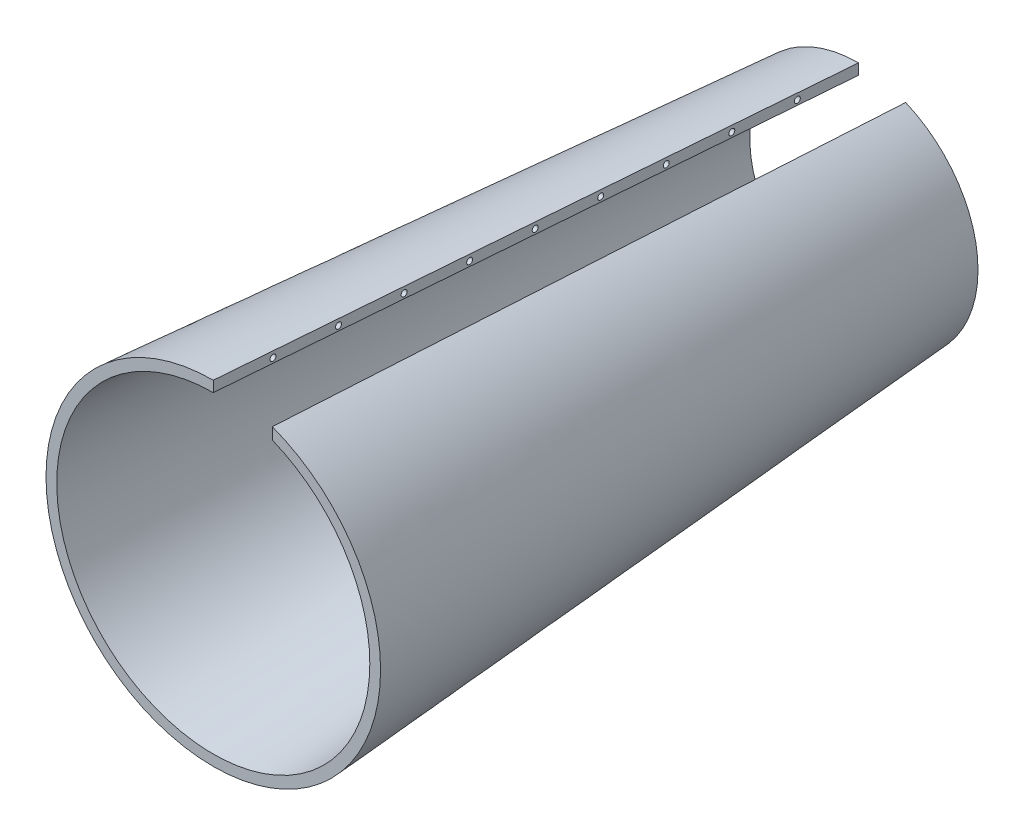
ISO-10303-21;
HEADER;
FILE_DESCRIPTION(('STEP AP214'),'2;1');
FILE_NAME('part.step','',(''),(''),'','','');
FILE_SCHEMA(('AUTOMOTIVE_DESIGN { 1 0 10303 214 1 1 1 1 }'));
ENDSEC;
DATA;
#1=APPLICATION_CONTEXT('core data for automotive mechanical design processes');
#2=APPLICATION_PROTOCOL_DEFINITION('international standard','automotive_design',2000,#1);
#3=PRODUCT_CONTEXT('',#1,'mechanical');
#4=PRODUCT('Part','Part','',(#3));
#5=PRODUCT_RELATED_PRODUCT_CATEGORY('part','',(#4));
#6=PRODUCT_DEFINITION_FORMATION('','',#4);
#7=PRODUCT_DEFINITION_CONTEXT('part definition',#1,'design');
#8=PRODUCT_DEFINITION('design','',#6,#7);
#9=PRODUCT_DEFINITION_SHAPE('','',#8);
#10=(LENGTH_UNIT() NAMED_UNIT(*) SI_UNIT(.MILLI.,.METRE.));
#11=(NAMED_UNIT(*) PLANE_ANGLE_UNIT() SI_UNIT($,.RADIAN.));
#12=(NAMED_UNIT(*) SI_UNIT($,.STERADIAN.) SOLID_ANGLE_UNIT());
#13=UNCERTAINTY_MEASURE_WITH_UNIT(LENGTH_MEASURE(1.E-05),#10,'distance_accuracy_value','');
#14=(GEOMETRIC_REPRESENTATION_CONTEXT(3) GLOBAL_UNCERTAINTY_ASSIGNED_CONTEXT((#13)) GLOBAL_UNIT_ASSIGNED_CONTEXT((#10,
#11,#12)) REPRESENTATION_CONTEXT('',''));
#15=CARTESIAN_POINT('',(0.,0.,0.));
#16=DIRECTION('',(0.,0.,1.));
#17=DIRECTION('',(1.,0.,0.));
#18=AXIS2_PLACEMENT_3D('',#15,#16,#17);
#19=CARTESIAN_POINT('',(0.,0.,270.));
#20=DIRECTION('',(0.,0.,1.));
#21=DIRECTION('',(1.,0.,0.));
#22=AXIS2_PLACEMENT_3D('',#19,#20,#21);
#23=PLANE('',#22);
#24=CARTESIAN_POINT('',(0.,0.,270.));
#25=DIRECTION('',(0.,0.,1.));
#26=DIRECTION('',(1.,0.,0.));
#27=AXIS2_PLACEMENT_3D('',#24,#25,#26);
#28=CIRCLE('',#27,70.);
#29=CARTESIAN_POINT('',(70.,0.,270.));
#30=VERTEX_POINT('',#29);
#31=CARTESIAN_POINT('',(24.6931164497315,65.5,270.));
#32=VERTEX_POINT('',#31);
#33=EDGE_CURVE('E328',#30,#32,#28,.T.);
#34=ORIENTED_EDGE('',*,*,#33,.T.);
#35=DIRECTION('',(0.,-1.,0.));
#36=VECTOR('',#35,1.);
#37=CARTESIAN_POINT('',(24.6931164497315,60.6671245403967,270.));
#38=LINE('',#37,#36);
#39=CARTESIAN_POINT('',(24.6931164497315,60.6671245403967,270.));
#40=VERTEX_POINT('',#39);
#41=EDGE_CURVE('E342',#32,#40,#38,.T.);
#42=ORIENTED_EDGE('',*,*,#41,.T.);
#43=CARTESIAN_POINT('',(0.,0.,270.));
#44=DIRECTION('',(0.,0.,-1.));
#45=DIRECTION('',(1.,0.,0.));
#46=AXIS2_PLACEMENT_3D('',#43,#44,#45);
#47=CIRCLE('',#46,65.5);
#48=CARTESIAN_POINT('',(65.5,0.,270.));
#49=VERTEX_POINT('',#48);
#50=EDGE_CURVE('E356',#40,#49,#47,.T.);
#51=ORIENTED_EDGE('',*,*,#50,.T.);
#52=CARTESIAN_POINT('',(0.,0.,270.));
#53=DIRECTION('',(0.,0.,-1.));
#54=DIRECTION('',(1.,0.,0.));
#55=AXIS2_PLACEMENT_3D('',#52,#53,#54);
#56=CIRCLE('',#55,65.5);
#57=CARTESIAN_POINT('',(0.,65.5,270.));
#58=VERTEX_POINT('',#57);
#59=EDGE_CURVE('E368',#49,#58,#56,.T.);
#60=ORIENTED_EDGE('',*,*,#59,.T.);
#61=DIRECTION('',(0.,1.,0.));
#62=VECTOR('',#61,1.);
#63=CARTESIAN_POINT('',(0.,70.,270.));
#64=LINE('',#63,#62);
#65=CARTESIAN_POINT('',(0.,70.,270.));
#66=VERTEX_POINT('',#65);
#67=EDGE_CURVE('E113',#58,#66,#64,.T.);
#68=ORIENTED_EDGE('',*,*,#67,.T.);
#69=CARTESIAN_POINT('',(0.,0.,270.));
#70=DIRECTION('',(0.,0.,1.));
#71=DIRECTION('',(1.,0.,0.));
#72=AXIS2_PLACEMENT_3D('',#69,#70,#71);
#73=CIRCLE('',#72,70.);
#74=EDGE_CURVE('E12',#66,#30,#73,.T.);
#75=ORIENTED_EDGE('',*,*,#74,.T.);
#76=EDGE_LOOP('',(#34,#42,#51,#60,#68,#75));
#77=FACE_BOUND('',#76,.T.);
#78=ADVANCED_FACE('F103',(#77),#23,.T.);
#79=CARTESIAN_POINT('',(0.,0.,0.));
#80=DIRECTION('',(0.,0.,1.));
#81=DIRECTION('',(1.,0.,0.));
#82=AXIS2_PLACEMENT_3D('',#79,#80,#81);
#83=PLANE('',#82);
#84=CARTESIAN_POINT('',(0.,0.,0.));
#85=DIRECTION('',(0.,0.,1.));
#86=DIRECTION('',(1.,0.,0.));
#87=AXIS2_PLACEMENT_3D('',#84,#85,#86);
#88=CIRCLE('',#87,50.);
#89=CARTESIAN_POINT('',(0.,50.,0.));
#90=VERTEX_POINT('',#89);
#91=CARTESIAN_POINT('',(50.,0.,0.));
#92=VERTEX_POINT('',#91);
#93=EDGE_CURVE('E161',#90,#92,#88,.T.);
#94=ORIENTED_EDGE('',*,*,#93,.F.);
#95=DIRECTION('',(0.,1.,0.));
#96=VECTOR('',#95,1.);
#97=CARTESIAN_POINT('',(0.,50.,0.));
#98=LINE('',#97,#96);
#99=CARTESIAN_POINT('',(0.,45.5,0.));
#100=VERTEX_POINT('',#99);
#101=EDGE_CURVE('E168',#100,#90,#98,.T.);
#102=ORIENTED_EDGE('',*,*,#101,.F.);
#103=CARTESIAN_POINT('',(0.,0.,0.));
#104=DIRECTION('',(0.,0.,-1.));
#105=DIRECTION('',(1.,0.,0.));
#106=AXIS2_PLACEMENT_3D('',#103,#104,#105);
#107=CIRCLE('',#106,45.5);
#108=CARTESIAN_POINT('',(45.5,0.,0.));
#109=VERTEX_POINT('',#108);
#110=EDGE_CURVE('E176',#109,#100,#107,.T.);
#111=ORIENTED_EDGE('',*,*,#110,.F.);
#112=CARTESIAN_POINT('',(0.,0.,0.));
#113=DIRECTION('',(0.,0.,-1.));
#114=DIRECTION('',(1.,0.,0.));
#115=AXIS2_PLACEMENT_3D('',#112,#113,#114);
#116=CIRCLE('',#115,45.5);
#117=CARTESIAN_POINT('',(19.7294196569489,41.,0.));
#118=VERTEX_POINT('',#117);
#119=EDGE_CURVE('E245',#118,#109,#116,.T.);
#120=ORIENTED_EDGE('',*,*,#119,.F.);
#121=DIRECTION('',(0.,-1.,0.));
#122=VECTOR('',#121,1.);
#123=CARTESIAN_POINT('',(19.7294196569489,45.5,0.));
#124=LINE('',#123,#122);
#125=CARTESIAN_POINT('',(19.7294196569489,45.5,0.));
#126=VERTEX_POINT('',#125);
#127=EDGE_CURVE('E243',#126,#118,#124,.T.);
#128=ORIENTED_EDGE('',*,*,#127,.F.);
#129=CARTESIAN_POINT('',(0.668966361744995,0.,0.));
#130=DIRECTION('',(0.,0.,1.));
#131=DIRECTION('',(1.,0.,0.));
#132=AXIS2_PLACEMENT_3D('',#129,#130,#131);
#133=CIRCLE('',#132,49.331033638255);
#134=EDGE_CURVE('E182',#92,#126,#133,.T.);
#135=ORIENTED_EDGE('',*,*,#134,.F.);
#136=EDGE_LOOP('',(#94,#102,#111,#120,#128,#135));
#137=FACE_BOUND('',#136,.T.);
#138=ADVANCED_FACE('F181',(#137),#83,.F.);
#139=CARTESIAN_POINT('',(45.5,0.,0.));
#140=CARTESIAN_POINT('',(65.5,0.,270.));
#141=CARTESIAN_POINT('',(45.5,-4.46695201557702,0.));
#142=CARTESIAN_POINT('',(65.5,-6.43044740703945,270.));
#143=CARTESIAN_POINT('',(44.175721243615,-13.4002968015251,0.));
#144=CARTESIAN_POINT('',(63.5935661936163,-19.2905530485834,270.000000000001));
#145=CARTESIAN_POINT('',(38.3829924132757,-25.646876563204,0.));
#146=CARTESIAN_POINT('',(55.2546533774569,-36.9203020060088,269.999999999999));
#147=CARTESIAN_POINT('',(29.2856677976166,-35.6844989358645,0.));
#148=CARTESIAN_POINT('',(42.1584306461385,-51.3700171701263,270.));
#149=CARTESIAN_POINT('',(17.6657844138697,-42.6491375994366,0.));
#150=CARTESIAN_POINT('',(25.4309864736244,-61.3959996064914,270.));
#151=CARTESIAN_POINT('',(4.52479025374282,-45.9407810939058,0.));
#152=CARTESIAN_POINT('',(6.51371523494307,-66.1345333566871,269.999999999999));
#153=CARTESIAN_POINT('',(-9.00599973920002,-45.2760616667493,0.));
#154=CARTESIAN_POINT('',(-12.9645719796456,-65.1776516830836,270.000000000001));
#155=CARTESIAN_POINT('',(-21.7611360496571,-40.7121918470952,0.));
#156=CARTESIAN_POINT('',(-31.3264525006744,-58.6076541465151,269.999999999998));
#157=CARTESIAN_POINT('',(-32.6422131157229,-32.642213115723,0.));
#158=CARTESIAN_POINT('',(-46.9904501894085,-46.9904501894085,270.000000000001));
#159=CARTESIAN_POINT('',(-40.7121918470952,-21.7611360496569,0.));
#160=CARTESIAN_POINT('',(-58.6076541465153,-31.3264525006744,270.));
#161=CARTESIAN_POINT('',(-45.2760616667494,-9.00599973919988,0.));
#162=CARTESIAN_POINT('',(-65.1776516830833,-12.9645719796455,269.999999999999));
#163=CARTESIAN_POINT('',(-45.9407810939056,4.52479025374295,0.));
#164=CARTESIAN_POINT('',(-66.1345333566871,6.51371523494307,270.000000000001));
#165=CARTESIAN_POINT('',(-42.6491375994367,17.6657844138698,0.));
#166=CARTESIAN_POINT('',(-61.3959996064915,25.4309864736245,270.));
#167=CARTESIAN_POINT('',(-35.6844989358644,29.2856677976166,0.));
#168=CARTESIAN_POINT('',(-51.3700171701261,42.1584306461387,270.));
#169=CARTESIAN_POINT('',(-25.6468765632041,38.3829924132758,0.));
#170=CARTESIAN_POINT('',(-36.9203020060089,55.2546533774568,270.));
#171=CARTESIAN_POINT('',(-13.400296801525,44.1757212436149,0.));
#172=CARTESIAN_POINT('',(-19.2905530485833,63.5935661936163,269.999999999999));
#173=CARTESIAN_POINT('',(-4.46695201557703,45.5,0.));
#174=CARTESIAN_POINT('',(-6.43044740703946,65.5,270.));
#175=CARTESIAN_POINT('',(0.,45.5,0.));
#176=CARTESIAN_POINT('',(0.,65.5,270.));
#177=B_SPLINE_SURFACE_WITH_KNOTS('',3,1,((#139,#140),(#141,#142),(#143,#144),(#145,#146),(#147,
#148),(#149,#150),(#151,#152),(#153,#154),(#155,#156),(#157,#158),(#159,#160),(#161,#162),(#163,
#164),(#165,#166),(#167,#168),(#169,#170),(#171,#172),(#173,#174),(#175,#176)),.UNSPECIFIED.,
.F.,.F.,.F.,(4,1,1,1,1,1,1,1,1,1,1,1,1,1,1,1,4),(2,2),(0.,0.0625,0.125,0.1875,0.25,0.3125,0.375,
0.4375,0.5,0.5625,0.625,0.6875,0.75,0.8125,0.875,0.9375,1.),(0.,1.),.UNSPECIFIED.);
#178=DIRECTION('',(0.,0.0738716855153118,0.997267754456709));
#179=VECTOR('',#178,1.);
#180=CARTESIAN_POINT('',(0.,55.5,135.));
#181=LINE('',#180,#179);
#182=EDGE_CURVE('E165',#100,#58,#181,.T.);
#183=DIRECTION('',(-0.0738716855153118,0.,-0.997267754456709));
#184=VECTOR('',#183,1.);
#185=CARTESIAN_POINT('',(55.5,0.,135.));
#186=LINE('',#185,#184);
#187=EDGE_CURVE('E175',#49,#109,#186,.T.);
#188=ORIENTED_EDGE('',*,*,#110,.T.);
#189=ORIENTED_EDGE('',*,*,#182,.T.);
#190=ORIENTED_EDGE('',*,*,#59,.F.);
#191=ORIENTED_EDGE('',*,*,#187,.T.);
#192=EDGE_LOOP('',(#188,#189,#190,#191));
#193=FACE_BOUND('',#192,.T.);
#194=ADVANCED_FACE('F205',(#193),#177,.T.);
#195=CARTESIAN_POINT('',(0.,45.5,0.));
#196=DIRECTION('',(1.,0.,0.));
#197=DIRECTION('',(0.,1.,0.));
#198=AXIS2_PLACEMENT_3D('',#195,#196,#197);
#199=PLANE('',#198);
#200=CARTESIAN_POINT('',(0.,65.6412988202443,245.));
#201=DIRECTION('',(1.,0.,0.));
#202=DIRECTION('',(0.,0.,-1.));
#203=AXIS2_PLACEMENT_3D('',#200,#201,#202);
#204=CIRCLE('',#203,1.24999999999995);
#205=CARTESIAN_POINT('',(0.,65.6412988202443,243.75));
#206=VERTEX_POINT('',#205);
#207=EDGE_CURVE('E955',#206,#206,#204,.T.);
#208=ORIENTED_EDGE('',*,*,#207,.F.);
#209=EDGE_LOOP('',(#208));
#210=FACE_BOUND('',#209,.T.);
#211=CARTESIAN_POINT('',(0.,63.6098274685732,217.575136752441));
#212=DIRECTION('',(1.,0.,0.));
#213=DIRECTION('',(0.,0.,-1.));
#214=AXIS2_PLACEMENT_3D('',#211,#212,#213);
#215=CIRCLE('',#214,1.24999999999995);
#216=CARTESIAN_POINT('',(0.,63.6098274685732,216.325136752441));
#217=VERTEX_POINT('',#216);
#218=EDGE_CURVE('E960',#217,#217,#215,.T.);
#219=ORIENTED_EDGE('',*,*,#218,.F.);
#220=EDGE_LOOP('',(#219));
#221=FACE_BOUND('',#220,.T.);
#222=CARTESIAN_POINT('',(0.,61.5783561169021,190.150273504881));
#223=DIRECTION('',(1.,0.,0.));
#224=DIRECTION('',(0.,0.,-1.));
#225=AXIS2_PLACEMENT_3D('',#222,#223,#224);
#226=CIRCLE('',#225,1.24999999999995);
#227=CARTESIAN_POINT('',(0.,61.5783561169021,188.900273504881));
#228=VERTEX_POINT('',#227);
#229=EDGE_CURVE('E968',#228,#228,#226,.T.);
#230=ORIENTED_EDGE('',*,*,#229,.F.);
#231=EDGE_LOOP('',(#230));
#232=FACE_BOUND('',#231,.T.);
#233=CARTESIAN_POINT('',(0.,59.5468847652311,162.725410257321));
#234=DIRECTION('',(1.,0.,0.));
#235=DIRECTION('',(0.,0.,-1.));
#236=AXIS2_PLACEMENT_3D('',#233,#234,#235);
#237=CIRCLE('',#236,1.24999999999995);
#238=CARTESIAN_POINT('',(0.,59.5468847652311,161.475410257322));
#239=VERTEX_POINT('',#238);
#240=EDGE_CURVE('E974',#239,#239,#237,.T.);
#241=ORIENTED_EDGE('',*,*,#240,.F.);
#242=EDGE_LOOP('',(#241));
#243=FACE_BOUND('',#242,.T.);
#244=CARTESIAN_POINT('',(0.,57.51541341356,135.300547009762));
#245=DIRECTION('',(1.,0.,0.));
#246=DIRECTION('',(0.,0.,-1.));
#247=AXIS2_PLACEMENT_3D('',#244,#245,#246);
#248=CIRCLE('',#247,1.24999999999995);
#249=CARTESIAN_POINT('',(0.,57.51541341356,134.050547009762));
#250=VERTEX_POINT('',#249);
#251=EDGE_CURVE('E980',#250,#250,#248,.T.);
#252=ORIENTED_EDGE('',*,*,#251,.F.);
#253=EDGE_LOOP('',(#252));
#254=FACE_BOUND('',#253,.T.);
#255=CARTESIAN_POINT('',(0.,55.4839420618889,107.875683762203));
#256=DIRECTION('',(1.,0.,0.));
#257=DIRECTION('',(0.,0.,-1.));
#258=AXIS2_PLACEMENT_3D('',#255,#256,#257);
#259=CIRCLE('',#258,1.24999999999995);
#260=CARTESIAN_POINT('',(0.,55.4839420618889,106.625683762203));
#261=VERTEX_POINT('',#260);
#262=EDGE_CURVE('E986',#261,#261,#259,.T.);
#263=ORIENTED_EDGE('',*,*,#262,.F.);
#264=EDGE_LOOP('',(#263));
#265=FACE_BOUND('',#264,.T.);
#266=CARTESIAN_POINT('',(0.,53.4524707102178,80.450820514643));
#267=DIRECTION('',(1.,0.,0.));
#268=DIRECTION('',(0.,0.,-1.));
#269=AXIS2_PLACEMENT_3D('',#266,#267,#268);
#270=CIRCLE('',#269,1.24999999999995);
#271=CARTESIAN_POINT('',(0.,53.4524707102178,79.200820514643));
#272=VERTEX_POINT('',#271);
#273=EDGE_CURVE('E992',#272,#272,#270,.T.);
#274=ORIENTED_EDGE('',*,*,#273,.F.);
#275=EDGE_LOOP('',(#274));
#276=FACE_BOUND('',#275,.T.);
#277=CARTESIAN_POINT('',(0.,51.4209993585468,53.0259572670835));
#278=DIRECTION('',(1.,0.,0.));
#279=DIRECTION('',(0.,0.,-1.));
#280=AXIS2_PLACEMENT_3D('',#277,#278,#279);
#281=CIRCLE('',#280,1.24999999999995);
#282=CARTESIAN_POINT('',(0.,51.4209993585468,51.7759572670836));
#283=VERTEX_POINT('',#282);
#284=EDGE_CURVE('E998',#283,#283,#281,.T.);
#285=ORIENTED_EDGE('',*,*,#284,.F.);
#286=EDGE_LOOP('',(#285));
#287=FACE_BOUND('',#286,.T.);
#288=CARTESIAN_POINT('',(0.,49.3895280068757,25.601094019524));
#289=DIRECTION('',(1.,0.,0.));
#290=DIRECTION('',(0.,0.,-1.));
#291=AXIS2_PLACEMENT_3D('',#288,#289,#290);
#292=CIRCLE('',#291,1.24999999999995);
#293=CARTESIAN_POINT('',(0.,49.3895280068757,24.3510940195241));
#294=VERTEX_POINT('',#293);
#295=EDGE_CURVE('E1004',#294,#294,#292,.T.);
#296=ORIENTED_EDGE('',*,*,#295,.F.);
#297=EDGE_LOOP('',(#296));
#298=FACE_BOUND('',#297,.T.);
#299=ORIENTED_EDGE('',*,*,#101,.T.);
#300=DIRECTION('',(0.,0.0738716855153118,0.997267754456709));
#301=VECTOR('',#300,1.);
#302=CARTESIAN_POINT('',(0.,60.,135.));
#303=LINE('',#302,#301);
#304=EDGE_CURVE('E128',#90,#66,#303,.T.);
#305=ORIENTED_EDGE('',*,*,#304,.T.);
#306=ORIENTED_EDGE('',*,*,#67,.F.);
#307=ORIENTED_EDGE('',*,*,#182,.F.);
#308=EDGE_LOOP('',(#299,#305,#306,#307));
#309=FACE_BOUND('',#308,.T.);
#310=ADVANCED_FACE('F170',(#210,#221,#232,#243,#254,#265,#276,#287,#298,#309),#199,.T.);
#311=CARTESIAN_POINT('',(19.7294196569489,41.,0.));
#312=CARTESIAN_POINT('',(24.6931164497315,60.6671245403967,270.));
#313=CARTESIAN_POINT('',(23.5639349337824,39.1548107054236,0.));
#314=CARTESIAN_POINT('',(30.6801905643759,58.2302277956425,270.));
#315=CARTESIAN_POINT('',(30.7118644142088,34.3822893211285,0.));
#316=CARTESIAN_POINT('',(41.9274824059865,51.5723371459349,270.));
#317=CARTESIAN_POINT('',(39.0312208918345,24.5331027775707,0.));
#318=CARTESIAN_POINT('',(55.1491661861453,37.095306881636,270.));
#319=CARTESIAN_POINT('',(44.2989257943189,12.7657983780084,0.));
#320=CARTESIAN_POINT('',(63.5735207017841,19.3914209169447,270.));
#321=CARTESIAN_POINT('',(45.5,4.25537670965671,0.));
#322=CARTESIAN_POINT('',(65.5,6.46401749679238,270.));
#323=CARTESIAN_POINT('',(45.5,0.,0.));
#324=CARTESIAN_POINT('',(65.5,0.,270.));
#325=B_SPLINE_SURFACE_WITH_KNOTS('',3,1,((#311,#312),(#313,#314),(#315,#316),(#317,#318),(#319,
#320),(#321,#322),(#323,#324)),.UNSPECIFIED.,.F.,.F.,.F.,(4,1,1,1,4),(2,2),(0.,0.25,0.5,0.75,
1.),(0.,1.),.UNSPECIFIED.);
#326=DIRECTION('',(0.0183324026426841,0.0726365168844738,0.99718998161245));
#327=VECTOR('',#326,1.);
#328=CARTESIAN_POINT('',(22.2112680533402,50.8335622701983,135.));
#329=LINE('',#328,#327);
#330=EDGE_CURVE('E399',#118,#40,#329,.T.);
#331=ORIENTED_EDGE('',*,*,#119,.T.);
#332=ORIENTED_EDGE('',*,*,#187,.F.);
#333=ORIENTED_EDGE('',*,*,#50,.F.);
#334=ORIENTED_EDGE('',*,*,#330,.F.);
#335=EDGE_LOOP('',(#331,#332,#333,#334));
#336=FACE_BOUND('',#335,.T.);
#337=ADVANCED_FACE('F270',(#336),#325,.T.);
#338=CARTESIAN_POINT('',(0.,50.,0.));
#339=CARTESIAN_POINT('',(0.,70.,270.));
#340=CARTESIAN_POINT('',(-2.44366964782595,50.,0.));
#341=CARTESIAN_POINT('',(-3.45137751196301,70.,270.));
#342=CARTESIAN_POINT('',(-7.33292244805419,49.6393433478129,0.));
#343=CARTESIAN_POINT('',(-10.3508208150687,69.487491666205,270.000000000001));
#344=CARTESIAN_POINT('',(-16.9094329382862,47.5022508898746,0.));
#345=CARTESIAN_POINT('',(-23.8401649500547,66.4499325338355,269.999999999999));
#346=CARTESIAN_POINT('',(-28.1082381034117,42.2266383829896,0.));
#347=CARTESIAN_POINT('',(-39.5630912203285,58.9836358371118,270.000000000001));
#348=CARTESIAN_POINT('',(-39.1483836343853,32.2607125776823,0.));
#349=CARTESIAN_POINT('',(-54.9915473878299,44.9430755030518,269.999999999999));
#350=CARTESIAN_POINT('',(-46.8294979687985,19.5059073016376,0.));
#351=CARTESIAN_POINT('',(-65.6669107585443,27.0469102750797,270.000000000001));
#352=CARTESIAN_POINT('',(-50.4777729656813,5.05809426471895,0.));
#353=CARTESIAN_POINT('',(-70.6872960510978,6.84016965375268,269.999999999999));
#354=CARTESIAN_POINT('',(-49.7686934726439,-9.83591105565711,0.));
#355=CARTESIAN_POINT('',(-69.6344475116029,-13.9408363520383,270.));
#356=CARTESIAN_POINT('',(-44.756885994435,-23.8858803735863,0.));
#357=CARTESIAN_POINT('',(-62.6085430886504,-33.5173127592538,270.));
#358=CARTESIAN_POINT('',(-35.8728851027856,-35.8728851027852,0.));
#359=CARTESIAN_POINT('',(-50.2155049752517,-50.2155049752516,270.));
#360=CARTESIAN_POINT('',(-23.8858803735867,-44.7568859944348,0.));
#361=CARTESIAN_POINT('',(-33.517312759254,-62.6085430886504,270.));
#362=CARTESIAN_POINT('',(-9.83591105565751,-49.7686934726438,0.));
#363=CARTESIAN_POINT('',(-13.9408363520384,-69.6344475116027,270.));
#364=CARTESIAN_POINT('',(5.05809426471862,-50.4777729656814,0.));
#365=CARTESIAN_POINT('',(6.84016965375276,-70.6872960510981,270.));
#366=CARTESIAN_POINT('',(19.5059073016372,-46.8294979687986,0.));
#367=CARTESIAN_POINT('',(27.0469102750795,-65.6669107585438,269.999999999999));
#368=CARTESIAN_POINT('',(32.2607125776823,-39.1483836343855,0.));
#369=CARTESIAN_POINT('',(44.9430755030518,-54.9915473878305,270.000000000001));
#370=CARTESIAN_POINT('',(42.2266383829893,-28.1082381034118,0.));
#371=CARTESIAN_POINT('',(58.9836358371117,-39.5630912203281,269.999999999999));
#372=CARTESIAN_POINT('',(47.5022508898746,-16.9094329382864,0.));
#373=CARTESIAN_POINT('',(66.4499325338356,-23.8401649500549,270.000000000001));
#374=CARTESIAN_POINT('',(49.6393433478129,-7.33292244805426,0.));
#375=CARTESIAN_POINT('',(69.4874916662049,-10.3508208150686,270.));
#376=CARTESIAN_POINT('',(50.,-2.44366964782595,0.));
#377=CARTESIAN_POINT('',(70.,-3.45137751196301,270.));
#378=CARTESIAN_POINT('',(50.,2.45610200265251,0.));
#379=CARTESIAN_POINT('',(70.,3.46893665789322,270.));
#380=CARTESIAN_POINT('',(49.6325193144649,7.33417139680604,0.));
#381=CARTESIAN_POINT('',(69.4829575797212,10.4515492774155,270.));
#382=CARTESIAN_POINT('',(48.0297048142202,14.4225118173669,0.));
#383=CARTESIAN_POINT('',(67.1222749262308,20.7926617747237,270.));
#384=CARTESIAN_POINT('',(45.4261454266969,21.1557287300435,0.));
#385=CARTESIAN_POINT('',(63.1990717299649,30.7245837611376,270.));
#386=CARTESIAN_POINT('',(41.8863834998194,27.4214315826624,0.));
#387=CARTESIAN_POINT('',(57.793873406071,39.9764930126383,270.));
#388=CARTESIAN_POINT('',(37.474961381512,33.1072298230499,0.));
#389=CARTESIAN_POINT('',(51.0434610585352,48.2979067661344,270.));
#390=CARTESIAN_POINT('',(32.2706036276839,38.110168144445,0.));
#391=CARTESIAN_POINT('',(43.1339642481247,55.4724769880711,270.000000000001));
#392=CARTESIAN_POINT('',(26.3520347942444,42.3272912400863,0.));
#393=CARTESIAN_POINT('',(34.2903891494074,61.3293199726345,269.999999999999));
#394=CARTESIAN_POINT('',(21.9947814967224,44.5510148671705,0.));
#395=CARTESIAN_POINT('',(27.9390500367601,64.2763020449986,270.));
#396=CARTESIAN_POINT('',(19.7294196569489,45.5,0.));
#397=CARTESIAN_POINT('',(24.6931164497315,65.5,270.));
#398=B_SPLINE_SURFACE_WITH_KNOTS('',3,1,((#338,#339),(#340,#341),(#342,#343),(#344,#345),(#346,
#347),(#348,#349),(#350,#351),(#352,#353),(#354,#355),(#356,#357),(#358,#359),(#360,#361),(#362,
#363),(#364,#365),(#366,#367),(#368,#369),(#370,#371),(#372,#373),(#374,#375),(#376,#377),(#378,
#379),(#380,#381),(#382,#383),(#384,#385),(#386,#387),(#388,#389),(#390,#391),(#392,#393),(#394,
#395),(#396,#397)),.UNSPECIFIED.,.F.,.F.,.F.,(4,1,1,1,1,1,1,1,1,1,1,1,1,1,1,1,1,1,2,1,1,1,1,1,1,
1,4),(2,2),(0.,0.0249745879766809,0.0499491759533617,0.0998983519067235,0.149847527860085,
0.199796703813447,0.249745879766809,0.29969505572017,0.349644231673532,0.399593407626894,
0.449542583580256,0.499491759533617,0.549440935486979,0.599390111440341,0.649339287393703,
0.699288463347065,0.749237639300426,0.774212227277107,0.799186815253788,0.824288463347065,
0.849390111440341,0.874491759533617,0.899593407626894,0.924695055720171,0.949796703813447,
0.974898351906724,1.),(0.,1.),.UNSPECIFIED.);
#399=DIRECTION('',(0.0183307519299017,0.0738592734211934,0.99710019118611));
#400=VECTOR('',#399,1.);
#401=CARTESIAN_POINT('',(22.2112680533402,55.5,135.));
#402=LINE('',#401,#400);
#403=EDGE_CURVE('E164',#126,#32,#402,.T.);
#404=ORIENTED_EDGE('',*,*,#93,.T.);
#405=ORIENTED_EDGE('',*,*,#134,.T.);
#406=ORIENTED_EDGE('',*,*,#403,.T.);
#407=ORIENTED_EDGE('',*,*,#33,.F.);
#408=ORIENTED_EDGE('',*,*,#74,.F.);
#409=ORIENTED_EDGE('',*,*,#304,.F.);
#410=EDGE_LOOP('',(#404,#405,#406,#407,#408,#409));
#411=FACE_BOUND('',#410,.T.);
#412=ADVANCED_FACE('F158',(#411),#398,.T.);
#413=CARTESIAN_POINT('',(19.7294196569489,45.5,0.));
#414=DIRECTION('',(-0.999831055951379,0.,0.0183809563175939));
#415=DIRECTION('',(0.,-1.,0.));
#416=AXIS2_PLACEMENT_3D('',#413,#414,#415);
#417=PLANE('',#416);
#418=CARTESIAN_POINT('',(24.1876401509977,60.9564600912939,242.504645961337));
#419=DIRECTION('',(-0.99983105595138,0.,0.0183809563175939));
#420=DIRECTION('',(0.0183809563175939,0.,0.99983105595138));
#421=AXIS2_PLACEMENT_3D('',#418,#419,#420);
#422=CIRCLE('',#421,1.24999999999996);
#423=CARTESIAN_POINT('',(24.2106163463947,60.9564600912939,243.754434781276));
#424=VERTEX_POINT('',#423);
#425=EDGE_CURVE('E1012',#424,#424,#422,.T.);
#426=ORIENTED_EDGE('',*,*,#425,.F.);
#427=EDGE_LOOP('',(#426));
#428=FACE_BOUND('',#427,.T.);
#429=CARTESIAN_POINT('',(23.6835444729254,58.9253300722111,215.084390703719));
#430=DIRECTION('',(-0.99983105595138,0.,0.0183809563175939));
#431=DIRECTION('',(0.0183809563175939,0.,0.99983105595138));
#432=AXIS2_PLACEMENT_3D('',#429,#430,#431);
#433=CIRCLE('',#432,1.24999999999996);
#434=CARTESIAN_POINT('',(23.7065206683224,58.9253300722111,216.334179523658));
#435=VERTEX_POINT('',#434);
#436=EDGE_CURVE('E1015',#435,#435,#433,.T.);
#437=ORIENTED_EDGE('',*,*,#436,.F.);
#438=EDGE_LOOP('',(#437));
#439=FACE_BOUND('',#438,.T.);
#440=CARTESIAN_POINT('',(23.1794487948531,56.8942000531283,187.664135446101));
#441=DIRECTION('',(-0.99983105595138,0.,0.0183809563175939));
#442=DIRECTION('',(0.0183809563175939,0.,0.99983105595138));
#443=AXIS2_PLACEMENT_3D('',#440,#441,#442);
#444=CIRCLE('',#443,1.24999999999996);
#445=CARTESIAN_POINT('',(23.2024249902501,56.8942000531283,188.91392426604));
#446=VERTEX_POINT('',#445);
#447=EDGE_CURVE('E1021',#446,#446,#444,.T.);
#448=ORIENTED_EDGE('',*,*,#447,.F.);
#449=EDGE_LOOP('',(#448));
#450=FACE_BOUND('',#449,.T.);
#451=CARTESIAN_POINT('',(22.6753531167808,54.8630700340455,160.243880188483));
#452=DIRECTION('',(-0.99983105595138,0.,0.0183809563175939));
#453=DIRECTION('',(0.0183809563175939,0.,0.99983105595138));
#454=AXIS2_PLACEMENT_3D('',#451,#452,#453);
#455=CIRCLE('',#454,1.24999999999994);
#456=CARTESIAN_POINT('',(22.6983293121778,54.8630700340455,161.493669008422));
#457=VERTEX_POINT('',#456);
#458=EDGE_CURVE('E1027',#457,#457,#455,.T.);
#459=ORIENTED_EDGE('',*,*,#458,.F.);
#460=EDGE_LOOP('',(#459));
#461=FACE_BOUND('',#460,.T.);
#462=CARTESIAN_POINT('',(22.1712574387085,52.8319400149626,132.823624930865));
#463=DIRECTION('',(-0.99983105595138,0.,0.0183809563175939));
#464=DIRECTION('',(0.0183809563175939,0.,0.99983105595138));
#465=AXIS2_PLACEMENT_3D('',#462,#463,#464);
#466=CIRCLE('',#465,1.24999999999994);
#467=CARTESIAN_POINT('',(22.1942336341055,52.8319400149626,134.073413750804));
#468=VERTEX_POINT('',#467);
#469=EDGE_CURVE('E1033',#468,#468,#466,.T.);
#470=ORIENTED_EDGE('',*,*,#469,.F.);
#471=EDGE_LOOP('',(#470));
#472=FACE_BOUND('',#471,.T.);
#473=CARTESIAN_POINT('',(21.6671617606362,50.8008099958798,105.403369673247));
#474=DIRECTION('',(-0.99983105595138,0.,0.0183809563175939));
#475=DIRECTION('',(0.0183809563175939,0.,0.99983105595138));
#476=AXIS2_PLACEMENT_3D('',#473,#474,#475);
#477=CIRCLE('',#476,1.24999999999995);
#478=CARTESIAN_POINT('',(21.6901379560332,50.8008099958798,106.653158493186));
#479=VERTEX_POINT('',#478);
#480=EDGE_CURVE('E1039',#479,#479,#477,.T.);
#481=ORIENTED_EDGE('',*,*,#480,.F.);
#482=EDGE_LOOP('',(#481));
#483=FACE_BOUND('',#482,.T.);
#484=CARTESIAN_POINT('',(21.1630660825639,48.769679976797,77.9831144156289));
#485=DIRECTION('',(-0.99983105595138,0.,0.0183809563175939));
#486=DIRECTION('',(0.0183809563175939,0.,0.99983105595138));
#487=AXIS2_PLACEMENT_3D('',#484,#485,#486);
#488=CIRCLE('',#487,1.24999999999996);
#489=CARTESIAN_POINT('',(21.1860422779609,48.769679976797,79.2329032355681));
#490=VERTEX_POINT('',#489);
#491=EDGE_CURVE('E1045',#490,#490,#488,.T.);
#492=ORIENTED_EDGE('',*,*,#491,.F.);
#493=EDGE_LOOP('',(#492));
#494=FACE_BOUND('',#493,.T.);
#495=CARTESIAN_POINT('',(20.6589704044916,46.7385499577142,50.5628591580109));
#496=DIRECTION('',(-0.99983105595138,0.,0.0183809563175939));
#497=DIRECTION('',(0.0183809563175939,0.,0.99983105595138));
#498=AXIS2_PLACEMENT_3D('',#495,#496,#497);
#499=CIRCLE('',#498,1.24999999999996);
#500=CARTESIAN_POINT('',(20.6819465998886,46.7385499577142,51.81264797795));
#501=VERTEX_POINT('',#500);
#502=EDGE_CURVE('E1051',#501,#501,#499,.T.);
#503=ORIENTED_EDGE('',*,*,#502,.F.);
#504=EDGE_LOOP('',(#503));
#505=FACE_BOUND('',#504,.T.);
#506=CARTESIAN_POINT('',(20.1548747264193,44.7074199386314,23.1426039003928));
#507=DIRECTION('',(-0.99983105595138,0.,0.0183809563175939));
#508=DIRECTION('',(0.0183809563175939,0.,0.99983105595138));
#509=AXIS2_PLACEMENT_3D('',#506,#507,#508);
#510=CIRCLE('',#509,1.24999999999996);
#511=CARTESIAN_POINT('',(20.1778509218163,44.7074199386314,24.392392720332));
#512=VERTEX_POINT('',#511);
#513=EDGE_CURVE('E958',#512,#512,#510,.T.);
#514=ORIENTED_EDGE('',*,*,#513,.F.);
#515=EDGE_LOOP('',(#514));
#516=FACE_BOUND('',#515,.T.);
#517=ORIENTED_EDGE('',*,*,#127,.T.);
#518=ORIENTED_EDGE('',*,*,#330,.T.);
#519=ORIENTED_EDGE('',*,*,#41,.F.);
#520=ORIENTED_EDGE('',*,*,#403,.F.);
#521=EDGE_LOOP('',(#517,#518,#519,#520));
#522=FACE_BOUND('',#521,.T.);
#523=ADVANCED_FACE('F303',(#428,#439,#450,#461,#472,#483,#494,#505,#516,#522),#417,.T.);
#524=CARTESIAN_POINT('',(22.6544523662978,44.7074199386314,23.0966515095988));
#525=DIRECTION('',(-0.99983105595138,0.,0.0183809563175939));
#526=DIRECTION('',(0.0183809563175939,0.,0.99983105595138));
#527=AXIS2_PLACEMENT_3D('',#524,#525,#526);
#528=CYLINDRICAL_SURFACE('',#527,1.24999999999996);
#529=CARTESIAN_POINT('',(22.6544523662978,44.7074199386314,23.0966515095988));
#530=DIRECTION('',(-0.99983105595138,0.,0.0183809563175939));
#531=DIRECTION('',(0.0183809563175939,0.,0.99983105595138));
#532=AXIS2_PLACEMENT_3D('',#529,#530,#531);
#533=CIRCLE('',#532,1.24999999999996);
#534=CARTESIAN_POINT('',(22.6774285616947,44.7074199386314,24.346440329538));
#535=VERTEX_POINT('',#534);
#536=EDGE_CURVE('E954',#535,#535,#533,.T.);
#537=ORIENTED_EDGE('',*,*,#536,.F.);
#538=EDGE_LOOP('',(#537));
#539=FACE_BOUND('',#538,.T.);
#540=ORIENTED_EDGE('',*,*,#513,.T.);
#541=EDGE_LOOP('',(#540));
#542=FACE_BOUND('',#541,.T.);
#543=ADVANCED_FACE('F460',(#539,#542),#528,.F.);
#544=CARTESIAN_POINT('',(22.6544523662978,44.7074199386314,23.0966515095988));
#545=DIRECTION('',(-0.99983105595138,0.,0.0183809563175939));
#546=DIRECTION('',(0.0183809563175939,0.,0.99983105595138));
#547=AXIS2_PLACEMENT_3D('',#544,#545,#546);
#548=PLANE('',#547);
#549=ORIENTED_EDGE('',*,*,#536,.T.);
#550=EDGE_LOOP('',(#549));
#551=FACE_BOUND('',#550,.T.);
#552=ADVANCED_FACE('F206',(#551),#548,.T.);
#553=CARTESIAN_POINT('',(23.1585480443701,46.7385499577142,50.5169067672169));
#554=DIRECTION('',(-0.99983105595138,0.,0.0183809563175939));
#555=DIRECTION('',(0.0183809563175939,0.,0.99983105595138));
#556=AXIS2_PLACEMENT_3D('',#553,#554,#555);
#557=CYLINDRICAL_SURFACE('',#556,1.24999999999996);
#558=CARTESIAN_POINT('',(23.1585480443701,46.7385499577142,50.5169067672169));
#559=DIRECTION('',(-0.99983105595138,0.,0.0183809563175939));
#560=DIRECTION('',(0.0183809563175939,0.,0.99983105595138));
#561=AXIS2_PLACEMENT_3D('',#558,#559,#560);
#562=CIRCLE('',#561,1.24999999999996);
#563=CARTESIAN_POINT('',(23.181524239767,46.7385499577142,51.7666955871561));
#564=VERTEX_POINT('',#563);
#565=EDGE_CURVE('E1054',#564,#564,#562,.T.);
#566=ORIENTED_EDGE('',*,*,#565,.F.);
#567=EDGE_LOOP('',(#566));
#568=FACE_BOUND('',#567,.T.);
#569=ORIENTED_EDGE('',*,*,#502,.T.);
#570=EDGE_LOOP('',(#569));
#571=FACE_BOUND('',#570,.T.);
#572=ADVANCED_FACE('F517',(#568,#571),#557,.F.);
#573=CARTESIAN_POINT('',(23.1585480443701,46.7385499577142,50.5169067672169));
#574=DIRECTION('',(-0.99983105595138,0.,0.0183809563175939));
#575=DIRECTION('',(0.0183809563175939,0.,0.99983105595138));
#576=AXIS2_PLACEMENT_3D('',#573,#574,#575);
#577=PLANE('',#576);
#578=ORIENTED_EDGE('',*,*,#565,.T.);
#579=EDGE_LOOP('',(#578));
#580=FACE_BOUND('',#579,.T.);
#581=ADVANCED_FACE('F527',(#580),#577,.T.);
#582=CARTESIAN_POINT('',(23.6626437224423,48.769679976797,77.9371620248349));
#583=DIRECTION('',(-0.99983105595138,0.,0.0183809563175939));
#584=DIRECTION('',(0.0183809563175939,0.,0.99983105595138));
#585=AXIS2_PLACEMENT_3D('',#582,#583,#584);
#586=CYLINDRICAL_SURFACE('',#585,1.24999999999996);
#587=CARTESIAN_POINT('',(23.6626437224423,48.769679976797,77.9371620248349));
#588=DIRECTION('',(-0.99983105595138,0.,0.0183809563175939));
#589=DIRECTION('',(0.0183809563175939,0.,0.99983105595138));
#590=AXIS2_PLACEMENT_3D('',#587,#588,#589);
#591=CIRCLE('',#590,1.24999999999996);
#592=CARTESIAN_POINT('',(23.6856199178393,48.769679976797,79.1869508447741));
#593=VERTEX_POINT('',#592);
#594=EDGE_CURVE('E1048',#593,#593,#591,.T.);
#595=ORIENTED_EDGE('',*,*,#594,.F.);
#596=EDGE_LOOP('',(#595));
#597=FACE_BOUND('',#596,.T.);
#598=ORIENTED_EDGE('',*,*,#491,.T.);
#599=EDGE_LOOP('',(#598));
#600=FACE_BOUND('',#599,.T.);
#601=ADVANCED_FACE('F538',(#597,#600),#586,.F.);
#602=CARTESIAN_POINT('',(23.6626437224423,48.769679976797,77.9371620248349));
#603=DIRECTION('',(-0.99983105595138,0.,0.0183809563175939));
#604=DIRECTION('',(0.0183809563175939,0.,0.99983105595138));
#605=AXIS2_PLACEMENT_3D('',#602,#603,#604);
#606=PLANE('',#605);
#607=ORIENTED_EDGE('',*,*,#594,.T.);
#608=EDGE_LOOP('',(#607));
#609=FACE_BOUND('',#608,.T.);
#610=ADVANCED_FACE('F549',(#609),#606,.T.);
#611=CARTESIAN_POINT('',(24.1667394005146,50.8008099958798,105.357417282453));
#612=DIRECTION('',(-0.99983105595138,0.,0.0183809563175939));
#613=DIRECTION('',(0.0183809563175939,0.,0.99983105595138));
#614=AXIS2_PLACEMENT_3D('',#611,#612,#613);
#615=CYLINDRICAL_SURFACE('',#614,1.24999999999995);
#616=CARTESIAN_POINT('',(24.1667394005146,50.8008099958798,105.357417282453));
#617=DIRECTION('',(-0.99983105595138,0.,0.0183809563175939));
#618=DIRECTION('',(0.0183809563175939,0.,0.99983105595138));
#619=AXIS2_PLACEMENT_3D('',#616,#617,#618);
#620=CIRCLE('',#619,1.24999999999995);
#621=CARTESIAN_POINT('',(24.1897155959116,50.8008099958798,106.607206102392));
#622=VERTEX_POINT('',#621);
#623=EDGE_CURVE('E1042',#622,#622,#620,.T.);
#624=ORIENTED_EDGE('',*,*,#623,.F.);
#625=EDGE_LOOP('',(#624));
#626=FACE_BOUND('',#625,.T.);
#627=ORIENTED_EDGE('',*,*,#480,.T.);
#628=EDGE_LOOP('',(#627));
#629=FACE_BOUND('',#628,.T.);
#630=ADVANCED_FACE('F560',(#626,#629),#615,.F.);
#631=CARTESIAN_POINT('',(24.1667394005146,50.8008099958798,105.357417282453));
#632=DIRECTION('',(-0.99983105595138,0.,0.0183809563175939));
#633=DIRECTION('',(0.0183809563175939,0.,0.99983105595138));
#634=AXIS2_PLACEMENT_3D('',#631,#632,#633);
#635=PLANE('',#634);
#636=ORIENTED_EDGE('',*,*,#623,.T.);
#637=EDGE_LOOP('',(#636));
#638=FACE_BOUND('',#637,.T.);
#639=ADVANCED_FACE('F571',(#638),#635,.T.);
#640=CARTESIAN_POINT('',(24.6708350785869,52.8319400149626,132.777672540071));
#641=DIRECTION('',(-0.99983105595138,0.,0.0183809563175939));
#642=DIRECTION('',(0.0183809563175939,0.,0.99983105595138));
#643=AXIS2_PLACEMENT_3D('',#640,#641,#642);
#644=CYLINDRICAL_SURFACE('',#643,1.24999999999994);
#645=CARTESIAN_POINT('',(24.6708350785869,52.8319400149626,132.777672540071));
#646=DIRECTION('',(-0.99983105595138,0.,0.0183809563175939));
#647=DIRECTION('',(0.0183809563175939,0.,0.99983105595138));
#648=AXIS2_PLACEMENT_3D('',#645,#646,#647);
#649=CIRCLE('',#648,1.24999999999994);
#650=CARTESIAN_POINT('',(24.6938112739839,52.8319400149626,134.02746136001));
#651=VERTEX_POINT('',#650);
#652=EDGE_CURVE('E1036',#651,#651,#649,.T.);
#653=ORIENTED_EDGE('',*,*,#652,.F.);
#654=EDGE_LOOP('',(#653));
#655=FACE_BOUND('',#654,.T.);
#656=ORIENTED_EDGE('',*,*,#469,.T.);
#657=EDGE_LOOP('',(#656));
#658=FACE_BOUND('',#657,.T.);
#659=ADVANCED_FACE('F582',(#655,#658),#644,.F.);
#660=CARTESIAN_POINT('',(24.6708350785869,52.8319400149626,132.777672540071));
#661=DIRECTION('',(-0.99983105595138,0.,0.0183809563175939));
#662=DIRECTION('',(0.0183809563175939,0.,0.99983105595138));
#663=AXIS2_PLACEMENT_3D('',#660,#661,#662);
#664=PLANE('',#663);
#665=ORIENTED_EDGE('',*,*,#652,.T.);
#666=EDGE_LOOP('',(#665));
#667=FACE_BOUND('',#666,.T.);
#668=ADVANCED_FACE('F593',(#667),#664,.T.);
#669=CARTESIAN_POINT('',(25.1749307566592,54.8630700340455,160.197927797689));
#670=DIRECTION('',(-0.99983105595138,0.,0.0183809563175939));
#671=DIRECTION('',(0.0183809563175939,0.,0.99983105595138));
#672=AXIS2_PLACEMENT_3D('',#669,#670,#671);
#673=CYLINDRICAL_SURFACE('',#672,1.24999999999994);
#674=CARTESIAN_POINT('',(25.1749307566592,54.8630700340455,160.197927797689));
#675=DIRECTION('',(-0.99983105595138,0.,0.0183809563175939));
#676=DIRECTION('',(0.0183809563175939,0.,0.99983105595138));
#677=AXIS2_PLACEMENT_3D('',#674,#675,#676);
#678=CIRCLE('',#677,1.24999999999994);
#679=CARTESIAN_POINT('',(25.1979069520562,54.8630700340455,161.447716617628));
#680=VERTEX_POINT('',#679);
#681=EDGE_CURVE('E1030',#680,#680,#678,.T.);
#682=ORIENTED_EDGE('',*,*,#681,.F.);
#683=EDGE_LOOP('',(#682));
#684=FACE_BOUND('',#683,.T.);
#685=ORIENTED_EDGE('',*,*,#458,.T.);
#686=EDGE_LOOP('',(#685));
#687=FACE_BOUND('',#686,.T.);
#688=ADVANCED_FACE('F604',(#684,#687),#673,.F.);
#689=CARTESIAN_POINT('',(25.1749307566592,54.8630700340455,160.197927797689));
#690=DIRECTION('',(-0.99983105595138,0.,0.0183809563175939));
#691=DIRECTION('',(0.0183809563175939,0.,0.99983105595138));
#692=AXIS2_PLACEMENT_3D('',#689,#690,#691);
#693=PLANE('',#692);
#694=ORIENTED_EDGE('',*,*,#681,.T.);
#695=EDGE_LOOP('',(#694));
#696=FACE_BOUND('',#695,.T.);
#697=ADVANCED_FACE('F615',(#696),#693,.T.);
#698=CARTESIAN_POINT('',(25.6790264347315,56.8942000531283,187.618183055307));
#699=DIRECTION('',(-0.99983105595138,0.,0.0183809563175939));
#700=DIRECTION('',(0.0183809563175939,0.,0.99983105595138));
#701=AXIS2_PLACEMENT_3D('',#698,#699,#700);
#702=CYLINDRICAL_SURFACE('',#701,1.24999999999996);
#703=CARTESIAN_POINT('',(25.6790264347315,56.8942000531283,187.618183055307));
#704=DIRECTION('',(-0.99983105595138,0.,0.0183809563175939));
#705=DIRECTION('',(0.0183809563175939,0.,0.99983105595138));
#706=AXIS2_PLACEMENT_3D('',#703,#704,#705);
#707=CIRCLE('',#706,1.24999999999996);
#708=CARTESIAN_POINT('',(25.7020026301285,56.8942000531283,188.867971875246));
#709=VERTEX_POINT('',#708);
#710=EDGE_CURVE('E1024',#709,#709,#707,.T.);
#711=ORIENTED_EDGE('',*,*,#710,.F.);
#712=EDGE_LOOP('',(#711));
#713=FACE_BOUND('',#712,.T.);
#714=ORIENTED_EDGE('',*,*,#447,.T.);
#715=EDGE_LOOP('',(#714));
#716=FACE_BOUND('',#715,.T.);
#717=ADVANCED_FACE('F626',(#713,#716),#702,.F.);
#718=CARTESIAN_POINT('',(25.6790264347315,56.8942000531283,187.618183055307));
#719=DIRECTION('',(-0.99983105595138,0.,0.0183809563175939));
#720=DIRECTION('',(0.0183809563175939,0.,0.99983105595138));
#721=AXIS2_PLACEMENT_3D('',#718,#719,#720);
#722=PLANE('',#721);
#723=ORIENTED_EDGE('',*,*,#710,.T.);
#724=EDGE_LOOP('',(#723));
#725=FACE_BOUND('',#724,.T.);
#726=ADVANCED_FACE('F637',(#725),#722,.T.);
#727=CARTESIAN_POINT('',(26.1831221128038,58.9253300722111,215.038438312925));
#728=DIRECTION('',(-0.99983105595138,0.,0.0183809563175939));
#729=DIRECTION('',(0.0183809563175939,0.,0.99983105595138));
#730=AXIS2_PLACEMENT_3D('',#727,#728,#729);
#731=CYLINDRICAL_SURFACE('',#730,1.24999999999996);
#732=CARTESIAN_POINT('',(26.1831221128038,58.9253300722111,215.038438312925));
#733=DIRECTION('',(-0.99983105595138,0.,0.0183809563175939));
#734=DIRECTION('',(0.0183809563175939,0.,0.99983105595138));
#735=AXIS2_PLACEMENT_3D('',#732,#733,#734);
#736=CIRCLE('',#735,1.24999999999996);
#737=CARTESIAN_POINT('',(26.2060983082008,58.9253300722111,216.288227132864));
#738=VERTEX_POINT('',#737);
#739=EDGE_CURVE('E1018',#738,#738,#736,.T.);
#740=ORIENTED_EDGE('',*,*,#739,.F.);
#741=EDGE_LOOP('',(#740));
#742=FACE_BOUND('',#741,.T.);
#743=ORIENTED_EDGE('',*,*,#436,.T.);
#744=EDGE_LOOP('',(#743));
#745=FACE_BOUND('',#744,.T.);
#746=ADVANCED_FACE('F648',(#742,#745),#731,.F.);
#747=CARTESIAN_POINT('',(26.1831221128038,58.9253300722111,215.038438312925));
#748=DIRECTION('',(-0.99983105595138,0.,0.0183809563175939));
#749=DIRECTION('',(0.0183809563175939,0.,0.99983105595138));
#750=AXIS2_PLACEMENT_3D('',#747,#748,#749);
#751=PLANE('',#750);
#752=ORIENTED_EDGE('',*,*,#739,.T.);
#753=EDGE_LOOP('',(#752));
#754=FACE_BOUND('',#753,.T.);
#755=ADVANCED_FACE('F659',(#754),#751,.T.);
#756=CARTESIAN_POINT('',(26.6872177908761,60.9564600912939,242.458693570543));
#757=DIRECTION('',(-0.99983105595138,0.,0.0183809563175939));
#758=DIRECTION('',(0.0183809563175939,0.,0.99983105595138));
#759=AXIS2_PLACEMENT_3D('',#756,#757,#758);
#760=CYLINDRICAL_SURFACE('',#759,1.24999999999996);
#761=CARTESIAN_POINT('',(26.6872177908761,60.9564600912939,242.458693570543));
#762=DIRECTION('',(-0.99983105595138,0.,0.0183809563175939));
#763=DIRECTION('',(0.0183809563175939,0.,0.99983105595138));
#764=AXIS2_PLACEMENT_3D('',#761,#762,#763);
#765=CIRCLE('',#764,1.24999999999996);
#766=CARTESIAN_POINT('',(26.7101939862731,60.9564600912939,243.708482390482));
#767=VERTEX_POINT('',#766);
#768=EDGE_CURVE('E184',#767,#767,#765,.T.);
#769=ORIENTED_EDGE('',*,*,#768,.F.);
#770=EDGE_LOOP('',(#769));
#771=FACE_BOUND('',#770,.T.);
#772=ORIENTED_EDGE('',*,*,#425,.T.);
#773=EDGE_LOOP('',(#772));
#774=FACE_BOUND('',#773,.T.);
#775=ADVANCED_FACE('F670',(#771,#774),#760,.F.);
#776=CARTESIAN_POINT('',(26.6872177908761,60.9564600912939,242.458693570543));
#777=DIRECTION('',(-0.99983105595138,0.,0.0183809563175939));
#778=DIRECTION('',(0.0183809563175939,0.,0.99983105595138));
#779=AXIS2_PLACEMENT_3D('',#776,#777,#778);
#780=PLANE('',#779);
#781=ORIENTED_EDGE('',*,*,#768,.T.);
#782=EDGE_LOOP('',(#781));
#783=FACE_BOUND('',#782,.T.);
#784=ADVANCED_FACE('F680',(#783),#780,.T.);
#785=CARTESIAN_POINT('',(-2.5,49.3895280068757,25.601094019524));
#786=DIRECTION('',(1.,0.,0.));
#787=DIRECTION('',(0.,0.,-1.));
#788=AXIS2_PLACEMENT_3D('',#785,#786,#787);
#789=CYLINDRICAL_SURFACE('',#788,1.24999999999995);
#790=CARTESIAN_POINT('',(-2.5,49.3895280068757,25.601094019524));
#791=DIRECTION('',(1.,0.,0.));
#792=DIRECTION('',(0.,0.,-1.));
#793=AXIS2_PLACEMENT_3D('',#790,#791,#792);
#794=CIRCLE('',#793,1.24999999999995);
#795=CARTESIAN_POINT('',(-2.5,49.3895280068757,24.3510940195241));
#796=VERTEX_POINT('',#795);
#797=EDGE_CURVE('E1007',#796,#796,#794,.T.);
#798=ORIENTED_EDGE('',*,*,#797,.F.);
#799=EDGE_LOOP('',(#798));
#800=FACE_BOUND('',#799,.T.);
#801=ORIENTED_EDGE('',*,*,#295,.T.);
#802=EDGE_LOOP('',(#801));
#803=FACE_BOUND('',#802,.T.);
#804=ADVANCED_FACE('F690',(#800,#803),#789,.F.);
#805=CARTESIAN_POINT('',(-2.5,49.3895280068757,25.601094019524));
#806=DIRECTION('',(1.,0.,0.));
#807=DIRECTION('',(0.,0.,-1.));
#808=AXIS2_PLACEMENT_3D('',#805,#806,#807);
#809=PLANE('',#808);
#810=ORIENTED_EDGE('',*,*,#797,.T.);
#811=EDGE_LOOP('',(#810));
#812=FACE_BOUND('',#811,.T.);
#813=ADVANCED_FACE('F701',(#812),#809,.T.);
#814=CARTESIAN_POINT('',(-2.5,51.4209993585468,53.0259572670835));
#815=DIRECTION('',(1.,0.,0.));
#816=DIRECTION('',(0.,0.,-1.));
#817=AXIS2_PLACEMENT_3D('',#814,#815,#816);
#818=CYLINDRICAL_SURFACE('',#817,1.24999999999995);
#819=CARTESIAN_POINT('',(-2.5,51.4209993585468,53.0259572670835));
#820=DIRECTION('',(1.,0.,0.));
#821=DIRECTION('',(0.,0.,-1.));
#822=AXIS2_PLACEMENT_3D('',#819,#820,#821);
#823=CIRCLE('',#822,1.24999999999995);
#824=CARTESIAN_POINT('',(-2.5,51.4209993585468,51.7759572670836));
#825=VERTEX_POINT('',#824);
#826=EDGE_CURVE('E1001',#825,#825,#823,.T.);
#827=ORIENTED_EDGE('',*,*,#826,.F.);
#828=EDGE_LOOP('',(#827));
#829=FACE_BOUND('',#828,.T.);
#830=ORIENTED_EDGE('',*,*,#284,.T.);
#831=EDGE_LOOP('',(#830));
#832=FACE_BOUND('',#831,.T.);
#833=ADVANCED_FACE('F708',(#829,#832),#818,.F.);
#834=CARTESIAN_POINT('',(-2.5,51.4209993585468,53.0259572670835));
#835=DIRECTION('',(1.,0.,0.));
#836=DIRECTION('',(0.,0.,-1.));
#837=AXIS2_PLACEMENT_3D('',#834,#835,#836);
#838=PLANE('',#837);
#839=ORIENTED_EDGE('',*,*,#826,.T.);
#840=EDGE_LOOP('',(#839));
#841=FACE_BOUND('',#840,.T.);
#842=ADVANCED_FACE('F716',(#841),#838,.T.);
#843=CARTESIAN_POINT('',(-2.5,53.4524707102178,80.450820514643));
#844=DIRECTION('',(1.,0.,0.));
#845=DIRECTION('',(0.,0.,-1.));
#846=AXIS2_PLACEMENT_3D('',#843,#844,#845);
#847=CYLINDRICAL_SURFACE('',#846,1.24999999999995);
#848=CARTESIAN_POINT('',(-2.5,53.4524707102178,80.450820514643));
#849=DIRECTION('',(1.,0.,0.));
#850=DIRECTION('',(0.,0.,-1.));
#851=AXIS2_PLACEMENT_3D('',#848,#849,#850);
#852=CIRCLE('',#851,1.24999999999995);
#853=CARTESIAN_POINT('',(-2.5,53.4524707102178,79.200820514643));
#854=VERTEX_POINT('',#853);
#855=EDGE_CURVE('E995',#854,#854,#852,.T.);
#856=ORIENTED_EDGE('',*,*,#855,.F.);
#857=EDGE_LOOP('',(#856));
#858=FACE_BOUND('',#857,.T.);
#859=ORIENTED_EDGE('',*,*,#273,.T.);
#860=EDGE_LOOP('',(#859));
#861=FACE_BOUND('',#860,.T.);
#862=ADVANCED_FACE('F724',(#858,#861),#847,.F.);
#863=CARTESIAN_POINT('',(-2.5,53.4524707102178,80.450820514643));
#864=DIRECTION('',(1.,0.,0.));
#865=DIRECTION('',(0.,0.,-1.));
#866=AXIS2_PLACEMENT_3D('',#863,#864,#865);
#867=PLANE('',#866);
#868=ORIENTED_EDGE('',*,*,#855,.T.);
#869=EDGE_LOOP('',(#868));
#870=FACE_BOUND('',#869,.T.);
#871=ADVANCED_FACE('F732',(#870),#867,.T.);
#872=CARTESIAN_POINT('',(-2.5,55.4839420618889,107.875683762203));
#873=DIRECTION('',(1.,0.,0.));
#874=DIRECTION('',(0.,0.,-1.));
#875=AXIS2_PLACEMENT_3D('',#872,#873,#874);
#876=CYLINDRICAL_SURFACE('',#875,1.24999999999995);
#877=CARTESIAN_POINT('',(-2.5,55.4839420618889,107.875683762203));
#878=DIRECTION('',(1.,0.,0.));
#879=DIRECTION('',(0.,0.,-1.));
#880=AXIS2_PLACEMENT_3D('',#877,#878,#879);
#881=CIRCLE('',#880,1.24999999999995);
#882=CARTESIAN_POINT('',(-2.5,55.4839420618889,106.625683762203));
#883=VERTEX_POINT('',#882);
#884=EDGE_CURVE('E989',#883,#883,#881,.T.);
#885=ORIENTED_EDGE('',*,*,#884,.F.);
#886=EDGE_LOOP('',(#885));
#887=FACE_BOUND('',#886,.T.);
#888=ORIENTED_EDGE('',*,*,#262,.T.);
#889=EDGE_LOOP('',(#888));
#890=FACE_BOUND('',#889,.T.);
#891=ADVANCED_FACE('F740',(#887,#890),#876,.F.);
#892=CARTESIAN_POINT('',(-2.5,55.4839420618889,107.875683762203));
#893=DIRECTION('',(1.,0.,0.));
#894=DIRECTION('',(0.,0.,-1.));
#895=AXIS2_PLACEMENT_3D('',#892,#893,#894);
#896=PLANE('',#895);
#897=ORIENTED_EDGE('',*,*,#884,.T.);
#898=EDGE_LOOP('',(#897));
#899=FACE_BOUND('',#898,.T.);
#900=ADVANCED_FACE('F748',(#899),#896,.T.);
#901=CARTESIAN_POINT('',(-2.5,57.51541341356,135.300547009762));
#902=DIRECTION('',(1.,0.,0.));
#903=DIRECTION('',(0.,0.,-1.));
#904=AXIS2_PLACEMENT_3D('',#901,#902,#903);
#905=CYLINDRICAL_SURFACE('',#904,1.24999999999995);
#906=CARTESIAN_POINT('',(-2.5,57.51541341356,135.300547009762));
#907=DIRECTION('',(1.,0.,0.));
#908=DIRECTION('',(0.,0.,-1.));
#909=AXIS2_PLACEMENT_3D('',#906,#907,#908);
#910=CIRCLE('',#909,1.24999999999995);
#911=CARTESIAN_POINT('',(-2.5,57.51541341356,134.050547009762));
#912=VERTEX_POINT('',#911);
#913=EDGE_CURVE('E983',#912,#912,#910,.T.);
#914=ORIENTED_EDGE('',*,*,#913,.F.);
#915=EDGE_LOOP('',(#914));
#916=FACE_BOUND('',#915,.T.);
#917=ORIENTED_EDGE('',*,*,#251,.T.);
#918=EDGE_LOOP('',(#917));
#919=FACE_BOUND('',#918,.T.);
#920=ADVANCED_FACE('F756',(#916,#919),#905,.F.);
#921=CARTESIAN_POINT('',(-2.5,57.51541341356,135.300547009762));
#922=DIRECTION('',(1.,0.,0.));
#923=DIRECTION('',(0.,0.,-1.));
#924=AXIS2_PLACEMENT_3D('',#921,#922,#923);
#925=PLANE('',#924);
#926=ORIENTED_EDGE('',*,*,#913,.T.);
#927=EDGE_LOOP('',(#926));
#928=FACE_BOUND('',#927,.T.);
#929=ADVANCED_FACE('F764',(#928),#925,.T.);
#930=CARTESIAN_POINT('',(-2.5,59.5468847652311,162.725410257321));
#931=DIRECTION('',(1.,0.,0.));
#932=DIRECTION('',(0.,0.,-1.));
#933=AXIS2_PLACEMENT_3D('',#930,#931,#932);
#934=CYLINDRICAL_SURFACE('',#933,1.24999999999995);
#935=CARTESIAN_POINT('',(-2.5,59.5468847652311,162.725410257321));
#936=DIRECTION('',(1.,0.,0.));
#937=DIRECTION('',(0.,0.,-1.));
#938=AXIS2_PLACEMENT_3D('',#935,#936,#937);
#939=CIRCLE('',#938,1.24999999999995);
#940=CARTESIAN_POINT('',(-2.5,59.5468847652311,161.475410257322));
#941=VERTEX_POINT('',#940);
#942=EDGE_CURVE('E977',#941,#941,#939,.T.);
#943=ORIENTED_EDGE('',*,*,#942,.F.);
#944=EDGE_LOOP('',(#943));
#945=FACE_BOUND('',#944,.T.);
#946=ORIENTED_EDGE('',*,*,#240,.T.);
#947=EDGE_LOOP('',(#946));
#948=FACE_BOUND('',#947,.T.);
#949=ADVANCED_FACE('F772',(#945,#948),#934,.F.);
#950=CARTESIAN_POINT('',(-2.5,59.5468847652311,162.725410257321));
#951=DIRECTION('',(1.,0.,0.));
#952=DIRECTION('',(0.,0.,-1.));
#953=AXIS2_PLACEMENT_3D('',#950,#951,#952);
#954=PLANE('',#953);
#955=ORIENTED_EDGE('',*,*,#942,.T.);
#956=EDGE_LOOP('',(#955));
#957=FACE_BOUND('',#956,.T.);
#958=ADVANCED_FACE('F780',(#957),#954,.T.);
#959=CARTESIAN_POINT('',(-2.5,61.5783561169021,190.150273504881));
#960=DIRECTION('',(1.,0.,0.));
#961=DIRECTION('',(0.,0.,-1.));
#962=AXIS2_PLACEMENT_3D('',#959,#960,#961);
#963=CYLINDRICAL_SURFACE('',#962,1.24999999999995);
#964=CARTESIAN_POINT('',(-2.5,61.5783561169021,190.150273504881));
#965=DIRECTION('',(1.,0.,0.));
#966=DIRECTION('',(0.,0.,-1.));
#967=AXIS2_PLACEMENT_3D('',#964,#965,#966);
#968=CIRCLE('',#967,1.24999999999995);
#969=CARTESIAN_POINT('',(-2.5,61.5783561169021,188.900273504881));
#970=VERTEX_POINT('',#969);
#971=EDGE_CURVE('E971',#970,#970,#968,.T.);
#972=ORIENTED_EDGE('',*,*,#971,.F.);
#973=EDGE_LOOP('',(#972));
#974=FACE_BOUND('',#973,.T.);
#975=ORIENTED_EDGE('',*,*,#229,.T.);
#976=EDGE_LOOP('',(#975));
#977=FACE_BOUND('',#976,.T.);
#978=ADVANCED_FACE('F788',(#974,#977),#963,.F.);
#979=CARTESIAN_POINT('',(-2.5,61.5783561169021,190.150273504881));
#980=DIRECTION('',(1.,0.,0.));
#981=DIRECTION('',(0.,0.,-1.));
#982=AXIS2_PLACEMENT_3D('',#979,#980,#981);
#983=PLANE('',#982);
#984=ORIENTED_EDGE('',*,*,#971,.T.);
#985=EDGE_LOOP('',(#984));
#986=FACE_BOUND('',#985,.T.);
#987=ADVANCED_FACE('F796',(#986),#983,.T.);
#988=CARTESIAN_POINT('',(-2.5,63.6098274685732,217.575136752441));
#989=DIRECTION('',(1.,0.,0.));
#990=DIRECTION('',(0.,0.,-1.));
#991=AXIS2_PLACEMENT_3D('',#988,#989,#990);
#992=CYLINDRICAL_SURFACE('',#991,1.24999999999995);
#993=CARTESIAN_POINT('',(-2.5,63.6098274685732,217.575136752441));
#994=DIRECTION('',(1.,0.,0.));
#995=DIRECTION('',(0.,0.,-1.));
#996=AXIS2_PLACEMENT_3D('',#993,#994,#995);
#997=CIRCLE('',#996,1.24999999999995);
#998=CARTESIAN_POINT('',(-2.5,63.6098274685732,216.325136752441));
#999=VERTEX_POINT('',#998);
#1000=EDGE_CURVE('E965',#999,#999,#997,.T.);
#1001=ORIENTED_EDGE('',*,*,#1000,.F.);
#1002=EDGE_LOOP('',(#1001));
#1003=FACE_BOUND('',#1002,.T.);
#1004=ORIENTED_EDGE('',*,*,#218,.T.);
#1005=EDGE_LOOP('',(#1004));
#1006=FACE_BOUND('',#1005,.T.);
#1007=ADVANCED_FACE('F804',(#1003,#1006),#992,.F.);
#1008=CARTESIAN_POINT('',(-2.5,63.6098274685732,217.575136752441));
#1009=DIRECTION('',(1.,0.,0.));
#1010=DIRECTION('',(0.,0.,-1.));
#1011=AXIS2_PLACEMENT_3D('',#1008,#1009,#1010);
#1012=PLANE('',#1011);
#1013=ORIENTED_EDGE('',*,*,#1000,.T.);
#1014=EDGE_LOOP('',(#1013));
#1015=FACE_BOUND('',#1014,.T.);
#1016=ADVANCED_FACE('F812',(#1015),#1012,.T.);
#1017=CARTESIAN_POINT('',(-2.5,65.6412988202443,245.));
#1018=DIRECTION('',(1.,0.,0.));
#1019=DIRECTION('',(0.,0.,-1.));
#1020=AXIS2_PLACEMENT_3D('',#1017,#1018,#1019);
#1021=CYLINDRICAL_SURFACE('',#1020,1.24999999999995);
#1022=CARTESIAN_POINT('',(-2.5,65.6412988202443,245.));
#1023=DIRECTION('',(1.,0.,0.));
#1024=DIRECTION('',(0.,0.,-1.));
#1025=AXIS2_PLACEMENT_3D('',#1022,#1023,#1024);
#1026=CIRCLE('',#1025,1.24999999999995);
#1027=CARTESIAN_POINT('',(-2.5,65.6412988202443,243.75));
#1028=VERTEX_POINT('',#1027);
#1029=EDGE_CURVE('E953',#1028,#1028,#1026,.T.);
#1030=ORIENTED_EDGE('',*,*,#1029,.F.);
#1031=EDGE_LOOP('',(#1030));
#1032=FACE_BOUND('',#1031,.T.);
#1033=ORIENTED_EDGE('',*,*,#207,.T.);
#1034=EDGE_LOOP('',(#1033));
#1035=FACE_BOUND('',#1034,.T.);
#1036=ADVANCED_FACE('F820',(#1032,#1035),#1021,.F.);
#1037=CARTESIAN_POINT('',(-2.5,65.6412988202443,245.));
#1038=DIRECTION('',(1.,0.,0.));
#1039=DIRECTION('',(0.,0.,-1.));
#1040=AXIS2_PLACEMENT_3D('',#1037,#1038,#1039);
#1041=PLANE('',#1040);
#1042=ORIENTED_EDGE('',*,*,#1029,.T.);
#1043=EDGE_LOOP('',(#1042));
#1044=FACE_BOUND('',#1043,.T.);
#1045=ADVANCED_FACE('F828',(#1044),#1041,.T.);
#1046=CLOSED_SHELL('',(#78,#138,#194,#310,#337,#412,#523,#543,#552,#572,#581,#601,#610,#630,
#639,#659,#668,#688,#697,#717,#726,#746,#755,#775,#784,#804,#813,#833,#842,#862,#871,#891,#900,
#920,#929,#949,#958,#978,#987,#1007,#1016,#1036,#1045));
#1047=MANIFOLD_SOLID_BREP('B2',#1046);
#1048=ADVANCED_BREP_SHAPE_REPRESENTATION('',(#18,#1047),#14);
#1049=SHAPE_DEFINITION_REPRESENTATION(#9,#1048);
ENDSEC;
END-ISO-10303-21;
